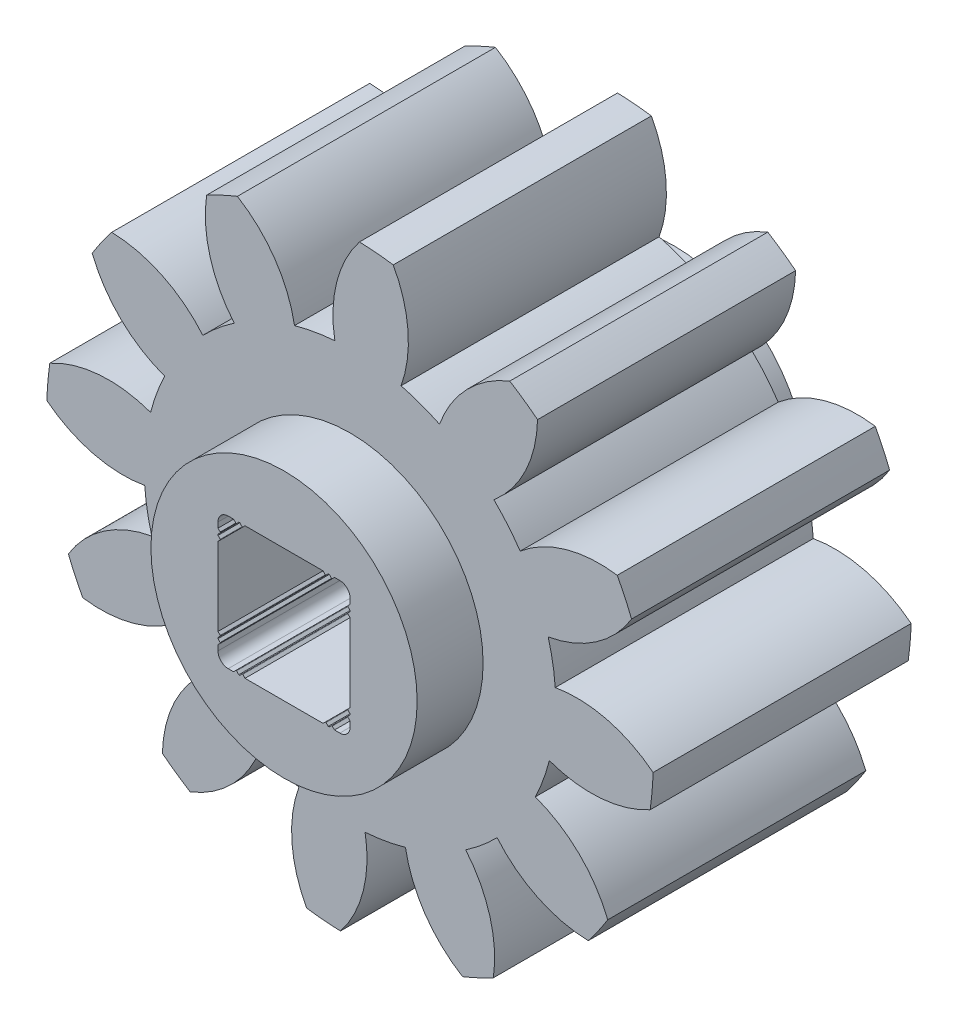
from build123d import *

# Parameters (mm, degrees)
SKETCH1_R          = 3.25
EXTRUDE1_DEPTH     = 4.76
SKETCH2_R          = 5.025
EXTRUDE2_DEPTH     = 3.15
EXTRUDE3_DEPTH     = 3.15
CIRPATTERN5_COUNT  = 12
CUT_EXTRUDE1_DEPTH = 9.52
FILLET1_R          = 0.25


with BuildPart() as part:
    # Sketch1 → Extrude1 (new, symmetric)
    with BuildSketch(Plane.XY):
        Circle(SKETCH1_R)
    extrude(amount=EXTRUDE1_DEPTH, both=True)

    # Sketch2 → Extrude2 (add, symmetric)
    with BuildSketch(Plane.XY):
        Circle(SKETCH2_R)
    extrude(amount=EXTRUDE2_DEPTH, both=True)

    # Sketch3 → Extrude3 (add, symmetric)
    with BuildSketch(Plane.XY):
        with BuildLine():
            Line((-0.369190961, 5.011419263), (-0.369190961, 4.484829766))
            ThreePointArc((-0.369190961, 4.484829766), (0.353907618, 4.48606168), (1.067867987, 4.371459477))
            Line((1.067867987, 4.371459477), (1.247191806, 4.867765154))
            ThreePointArc((1.247191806, 4.867765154), (1.416792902, 6.118424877), (1.057001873, 7.328162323))
            ThreePointArc((1.057001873, 7.328162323), (0.645301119, 7.375825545), (0.231578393, 7.400377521))
            ThreePointArc((0.231578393, 7.400377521), (-0.325314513, 6.270404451), (-0.369190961, 5.011419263))
        make_face()
    extrude3 = extrude(amount=EXTRUDE3_DEPTH, both=True)

    # CirPattern5: Extrude3 ×12 about axis
    cirpattern5_axis = Axis((0, 0, 0), (0, 0, 1))
    for i in range(1, CIRPATTERN5_COUNT):
        add(extrude3.rotate(cirpattern5_axis, i * 360 / CIRPATTERN5_COUNT))

    # Sketch4 → Cut-Extrude1 (cut)
    with BuildSketch(Plane.XY.offset(4.76)):
        with BuildLine():
            Line((1.6125, 0.952099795), (1.6125, -0.952099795))
            Line((1.6125, -0.952099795), (1.557865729, -1.007120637))
            ThreePointArc((1.557865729, -1.007120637), (1.554170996, -1.015749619), (1.557660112, -1.024463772))
            Line((1.557660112, -1.024463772), (1.612552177, -1.079227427))
            Line((1.612552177, -1.079227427), (1.612552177, -1.104627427))
            Line((1.612552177, -1.104627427), (1.557765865, -1.159496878))
            ThreePointArc((1.557765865, -1.159496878), (1.55631121, -1.168428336), (1.557765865, -1.177359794))
            Line((1.557765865, -1.177359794), (1.612604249, -1.231499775))
            Line((1.612604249, -1.231499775), (1.612604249, -1.612977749))
            Line((1.612604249, -1.612977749), (1.231613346, -1.612977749))
            Line((1.231613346, -1.612977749), (1.177537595, -1.558076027))
            ThreePointArc((1.177537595, -1.558076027), (1.168505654, -1.554272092), (1.159441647, -1.557998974))
            Line((1.159441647, -1.557998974), (1.104962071, -1.6125))
            Line((1.104962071, -1.6125), (1.079562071, -1.6125))
            Line((1.079562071, -1.6125), (1.02507177, -1.558009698))
            ThreePointArc((1.02507177, -1.558009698), (1.015878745, -1.554215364), (1.006756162, -1.558176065))
            Line((1.006756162, -1.558176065), (0.9521, -1.6125))
            Line((0.9521, -1.6125), (-0.9521, -1.6125))
            Line((-0.9521, -1.6125), (-1.006756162, -1.558176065))
            ThreePointArc((-1.006756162, -1.558176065), (-1.015878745, -1.554215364), (-1.02507177, -1.558009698))
            Line((-1.02507177, -1.558009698), (-1.079562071, -1.6125))
            Line((-1.079562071, -1.6125), (-1.104962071, -1.6125))
            Line((-1.104962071, -1.6125), (-1.159441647, -1.557998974))
            ThreePointArc((-1.159441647, -1.557998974), (-1.168505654, -1.554272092), (-1.177537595, -1.558076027))
            Line((-1.177537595, -1.558076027), (-1.231613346, -1.612977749))
            Line((-1.231613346, -1.612977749), (-1.612604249, -1.612977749))
            Line((-1.612604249, -1.612977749), (-1.612604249, -1.231499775))
            Line((-1.612604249, -1.231499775), (-1.557765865, -1.177359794))
            ThreePointArc((-1.557765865, -1.177359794), (-1.55631121, -1.168428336), (-1.557765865, -1.159496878))
            Line((-1.557765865, -1.159496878), (-1.612552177, -1.104627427))
            Line((-1.612552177, -1.104627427), (-1.612552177, -1.079227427))
            Line((-1.612552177, -1.079227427), (-1.557660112, -1.024463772))
            ThreePointArc((-1.557660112, -1.024463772), (-1.554170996, -1.015749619), (-1.557865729, -1.007120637))
            Line((-1.557865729, -1.007120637), (-1.6125, -0.952099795))
            Line((-1.6125, -0.952099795), (-1.6125, 0.952099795))
            Line((-1.6125, 0.952099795), (-1.557865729, 1.007120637))
            ThreePointArc((-1.557865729, 1.007120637), (-1.554170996, 1.015749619), (-1.557660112, 1.024463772))
            Line((-1.557660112, 1.024463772), (-1.612552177, 1.079227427))
            Line((-1.612552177, 1.079227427), (-1.612552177, 1.104627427))
            Line((-1.612552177, 1.104627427), (-1.557765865, 1.159496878))
            ThreePointArc((-1.557765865, 1.159496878), (-1.55631121, 1.168428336), (-1.557765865, 1.177359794))
            Line((-1.557765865, 1.177359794), (-1.612604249, 1.231499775))
            Line((-1.612604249, 1.231499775), (-1.612604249, 1.612977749))
            Line((-1.612604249, 1.612977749), (-1.231613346, 1.612977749))
            Line((-1.231613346, 1.612977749), (-1.177537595, 1.558076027))
            ThreePointArc((-1.177537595, 1.558076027), (-1.168505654, 1.554272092), (-1.159441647, 1.557998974))
            Line((-1.159441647, 1.557998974), (-1.104962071, 1.6125))
            Line((-1.104962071, 1.6125), (-1.079562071, 1.6125))
            Line((-1.079562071, 1.6125), (-1.02507177, 1.558009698))
            ThreePointArc((-1.02507177, 1.558009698), (-1.015878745, 1.554215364), (-1.006756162, 1.558176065))
            Line((-1.006756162, 1.558176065), (-0.9521, 1.6125))
            Line((-0.9521, 1.6125), (0.9521, 1.6125))
            Line((0.9521, 1.6125), (1.006756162, 1.558176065))
            ThreePointArc((1.006756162, 1.558176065), (1.015878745, 1.554215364), (1.02507177, 1.558009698))
            Line((1.02507177, 1.558009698), (1.079562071, 1.6125))
            Line((1.079562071, 1.6125), (1.104962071, 1.6125))
            Line((1.104962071, 1.6125), (1.159441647, 1.557998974))
            ThreePointArc((1.159441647, 1.557998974), (1.168505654, 1.554272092), (1.177537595, 1.558076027))
            Line((1.177537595, 1.558076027), (1.231613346, 1.612977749))
            Line((1.231613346, 1.612977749), (1.612604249, 1.612977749))
            Line((1.612604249, 1.612977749), (1.612604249, 1.231499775))
            Line((1.612604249, 1.231499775), (1.557765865, 1.177359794))
            ThreePointArc((1.557765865, 1.177359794), (1.55631121, 1.168428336), (1.557765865, 1.159496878))
            Line((1.557765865, 1.159496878), (1.612552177, 1.104627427))
            Line((1.612552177, 1.104627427), (1.612552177, 1.079227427))
            Line((1.612552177, 1.079227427), (1.557660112, 1.024463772))
            ThreePointArc((1.557660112, 1.024463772), (1.554170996, 1.015749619), (1.557865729, 1.007120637))
            Line((1.557865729, 1.007120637), (1.6125, 0.952099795))
        make_face()
    extrude(amount=-CUT_EXTRUDE1_DEPTH, mode=Mode.SUBTRACT)

    # Fillet1
    fillet1_edges = [part.edges().sort_by_distance(p)[0] for p in [
        (1.612604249, 1.612977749, 0),
        (1.612604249, -1.612977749, 0),
        (-1.612604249, -1.612977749, 0),
        (-1.612604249, 1.612977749, 0),
    ]]
    fillet(fillet1_edges, radius=FILLET1_R)


solid = part.part
